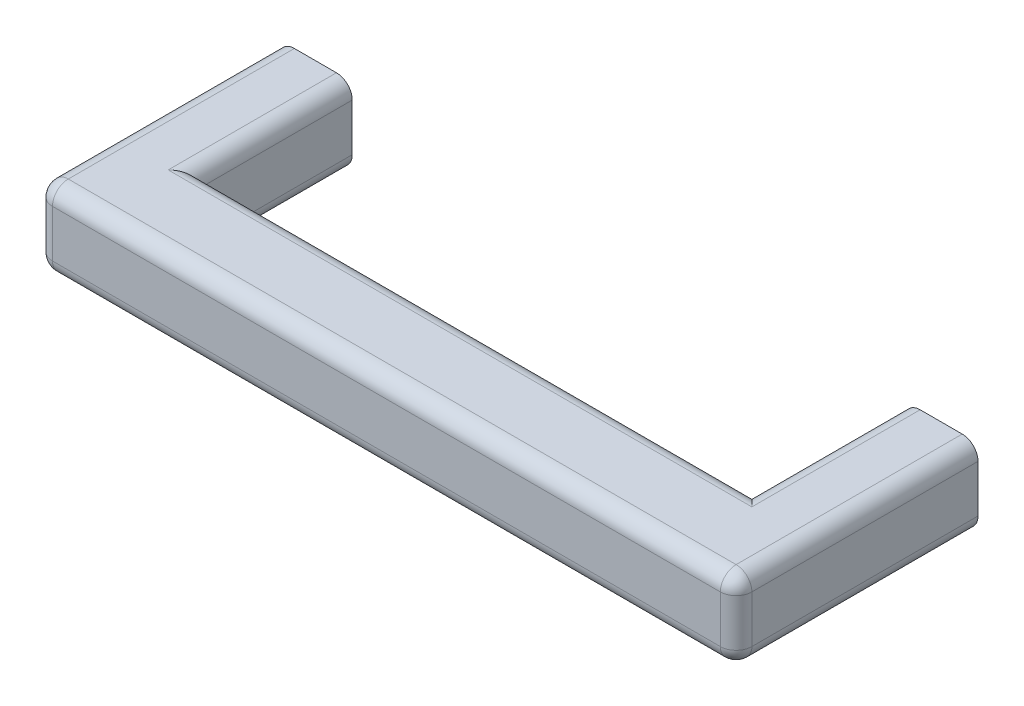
from build123d import *

# Parameters (mm, degrees)
AUFSATZ_LINEAR_AUSTRAGEN1_DEPTH = 15
VERRUNDUNG2_R                   = 3
SKIZZE2_R                       = 2.010223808
SCHNITT_LINEAR_AUSTRAGEN1_DEPTH = 10


with BuildPart() as part:
    # Skizze1 → Aufsatz-Linear austragen1 (new body)
    with BuildSketch(Plane(origin=(0, 0, 0), x_dir=(1, 0, 0), z_dir=(0, 1, 0))):
        Polygon((66.5, 0), (-66.5, 0), (-66.5, 46), (-52.5, 46), (-52.5, 17), (52.5, 17), (52.5, 46), (66.5, 46), align=None)
    extrude(amount=AUFSATZ_LINEAR_AUSTRAGEN1_DEPTH)

    # Verrundung2
    verrundung2_edges = [part.edges().sort_by_distance(p)[0] for p in [
        (66.5, 15, -23),
        (0, 0, 0),
        (-66.5, 0, -23),
        (66.5, 7.5, 0),
        (-66.5, 7.5, 0),
        (52.5, 15, -31.5),
        (0, 15, -17),
        (-52.5, 15, -31.5),
        (-66.5, 15, -23),
        (0, 15, 0),
        (-52.5, 0, -31.5),
        (0, 0, -17),
        (52.5, 0, -31.5),
        (66.5, 0, -23),
    ]]
    fillet(verrundung2_edges, radius=VERRUNDUNG2_R)

    # Skizze2 → Schnitt-Linear austragen1 (cut)
    with BuildSketch(Plane(origin=(0, 0, -46), x_dir=(-1, 0, 0), z_dir=(0, 0, -1))):
        with Locations((-59.5, 7.5)):
            Circle(SKIZZE2_R)
        with Locations(Location((59.5, 7.5, 0), (0, 0, 180))):
            Circle(SKIZZE2_R)
    extrude(amount=-SCHNITT_LINEAR_AUSTRAGEN1_DEPTH, mode=Mode.SUBTRACT)


solid = part.part
